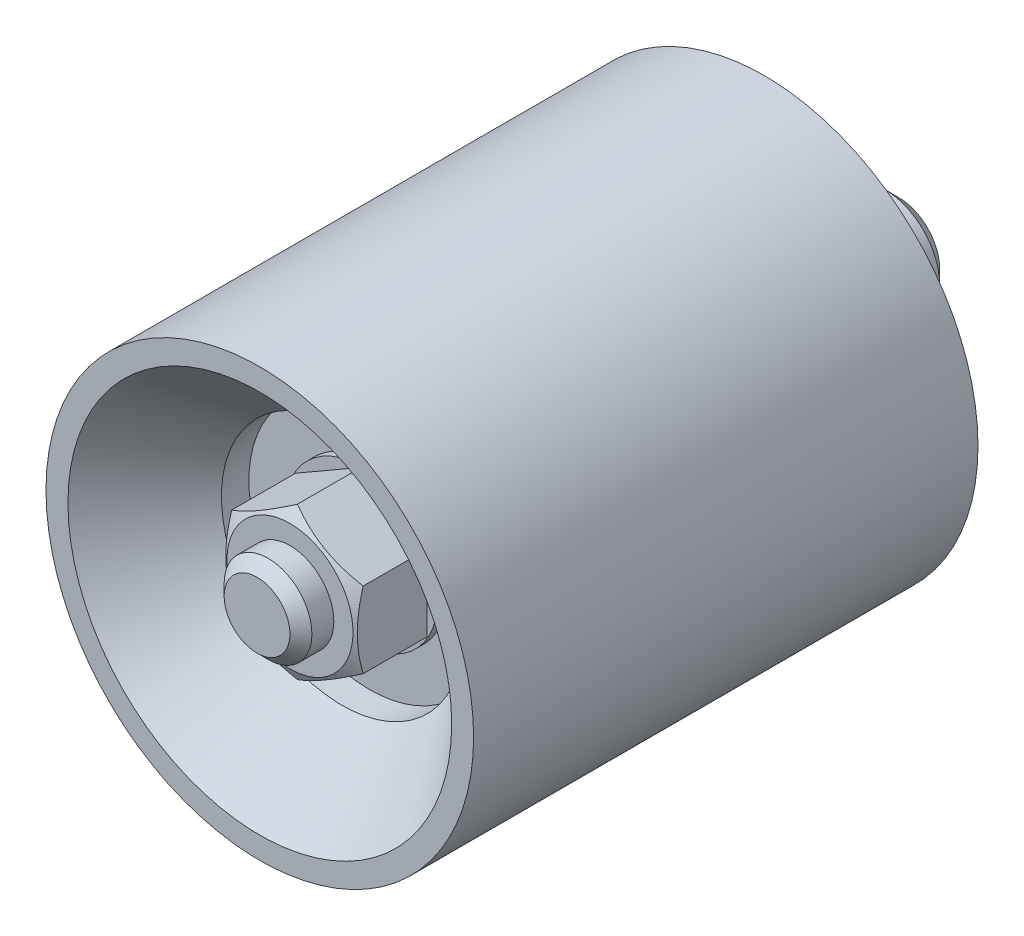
ISO-10303-21;
HEADER;
FILE_DESCRIPTION(('STEP AP214'),'2;1');
FILE_NAME('part.step','',(''),(''),'','','');
FILE_SCHEMA(('AUTOMOTIVE_DESIGN { 1 0 10303 214 1 1 1 1 }'));
ENDSEC;
DATA;
#1=APPLICATION_CONTEXT('core data for automotive mechanical design processes');
#2=APPLICATION_PROTOCOL_DEFINITION('international standard','automotive_design',2000,#1);
#3=PRODUCT_CONTEXT('',#1,'mechanical');
#4=PRODUCT('Part','Part','',(#3));
#5=PRODUCT_RELATED_PRODUCT_CATEGORY('part','',(#4));
#6=PRODUCT_DEFINITION_FORMATION('','',#4);
#7=PRODUCT_DEFINITION_CONTEXT('part definition',#1,'design');
#8=PRODUCT_DEFINITION('design','',#6,#7);
#9=PRODUCT_DEFINITION_SHAPE('','',#8);
#10=(LENGTH_UNIT() NAMED_UNIT(*) SI_UNIT(.MILLI.,.METRE.));
#11=(NAMED_UNIT(*) PLANE_ANGLE_UNIT() SI_UNIT($,.RADIAN.));
#12=(NAMED_UNIT(*) SI_UNIT($,.STERADIAN.) SOLID_ANGLE_UNIT());
#13=UNCERTAINTY_MEASURE_WITH_UNIT(LENGTH_MEASURE(1.E-05),#10,'distance_accuracy_value','');
#14=(GEOMETRIC_REPRESENTATION_CONTEXT(3) GLOBAL_UNCERTAINTY_ASSIGNED_CONTEXT((#13)) GLOBAL_UNIT_ASSIGNED_CONTEXT((#10,
#11,#12)) REPRESENTATION_CONTEXT('',''));
#15=CARTESIAN_POINT('',(0.,0.,0.));
#16=DIRECTION('',(0.,0.,1.));
#17=DIRECTION('',(1.,0.,0.));
#18=AXIS2_PLACEMENT_3D('',#15,#16,#17);
#19=CARTESIAN_POINT('',(0.,-50.,94.));
#20=DIRECTION('',(0.,0.,1.));
#21=DIRECTION('',(-1.,0.,0.));
#22=AXIS2_PLACEMENT_3D('',#19,#20,#21);
#23=PLANE('',#22);
#24=CARTESIAN_POINT('',(0.,0.,94.));
#25=DIRECTION('',(0.,0.,-1.));
#26=DIRECTION('',(1.,0.,0.));
#27=AXIS2_PLACEMENT_3D('',#24,#25,#26);
#28=CIRCLE('',#27,35.);
#29=CARTESIAN_POINT('',(35.,0.,94.));
#30=VERTEX_POINT('',#29);
#31=EDGE_CURVE('E196',#30,#30,#28,.T.);
#32=ORIENTED_EDGE('',*,*,#31,.T.);
#33=EDGE_LOOP('',(#32));
#34=FACE_BOUND('',#33,.T.);
#35=CARTESIAN_POINT('',(0.,0.,94.));
#36=DIRECTION('',(0.,0.,1.));
#37=DIRECTION('',(1.,0.,0.));
#38=AXIS2_PLACEMENT_3D('',#35,#36,#37);
#39=CIRCLE('',#38,39.);
#40=CARTESIAN_POINT('',(39.,0.,94.));
#41=VERTEX_POINT('',#40);
#42=EDGE_CURVE('E623',#41,#41,#39,.T.);
#43=ORIENTED_EDGE('',*,*,#42,.T.);
#44=EDGE_LOOP('',(#43));
#45=FACE_BOUND('',#44,.T.);
#46=ADVANCED_FACE('F15',(#34,#45),#23,.T.);
#47=CARTESIAN_POINT('',(0.,-10.,74.));
#48=DIRECTION('',(0.,0.,-1.));
#49=DIRECTION('',(1.,0.,0.));
#50=AXIS2_PLACEMENT_3D('',#47,#48,#49);
#51=PLANE('',#50);
#52=CARTESIAN_POINT('',(0.,0.,74.));
#53=DIRECTION('',(0.,0.,-1.));
#54=DIRECTION('',(1.,0.,0.));
#55=AXIS2_PLACEMENT_3D('',#52,#53,#54);
#56=CIRCLE('',#55,22.);
#57=CARTESIAN_POINT('',(22.,0.,74.));
#58=VERTEX_POINT('',#57);
#59=EDGE_CURVE('E151',#58,#58,#56,.T.);
#60=ORIENTED_EDGE('',*,*,#59,.F.);
#61=EDGE_LOOP('',(#60));
#62=FACE_BOUND('',#61,.T.);
#63=CARTESIAN_POINT('',(0.,0.,74.));
#64=DIRECTION('',(0.,0.,1.));
#65=DIRECTION('',(1.,0.,0.));
#66=AXIS2_PLACEMENT_3D('',#63,#64,#65);
#67=CIRCLE('',#66,14.);
#68=CARTESIAN_POINT('',(14.,0.,74.));
#69=VERTEX_POINT('',#68);
#70=EDGE_CURVE('E136',#69,#69,#67,.T.);
#71=ORIENTED_EDGE('',*,*,#70,.F.);
#72=EDGE_LOOP('',(#71));
#73=FACE_BOUND('',#72,.T.);
#74=ADVANCED_FACE('F345',(#62,#73),#51,.F.);
#75=CARTESIAN_POINT('',(0.,0.,28.0000000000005));
#76=DIRECTION('',(0.,0.,-1.));
#77=DIRECTION('',(1.,0.,0.));
#78=AXIS2_PLACEMENT_3D('',#75,#76,#77);
#79=CYLINDRICAL_SURFACE('',#78,22.);
#80=CARTESIAN_POINT('',(0.,0.,79.));
#81=DIRECTION('',(0.,0.,-1.));
#82=DIRECTION('',(1.,0.,0.));
#83=AXIS2_PLACEMENT_3D('',#80,#81,#82);
#84=CIRCLE('',#83,22.);
#85=CARTESIAN_POINT('',(22.,0.,79.));
#86=VERTEX_POINT('',#85);
#87=EDGE_CURVE('E199',#86,#86,#84,.T.);
#88=ORIENTED_EDGE('',*,*,#87,.F.);
#89=EDGE_LOOP('',(#88));
#90=FACE_BOUND('',#89,.T.);
#91=ORIENTED_EDGE('',*,*,#59,.T.);
#92=EDGE_LOOP('',(#91));
#93=FACE_BOUND('',#92,.T.);
#94=ADVANCED_FACE('F350',(#90,#93),#79,.F.);
#95=CARTESIAN_POINT('',(0.,0.,79.));
#96=DIRECTION('',(0.,0.,1.));
#97=DIRECTION('',(-1.,0.,0.));
#98=AXIS2_PLACEMENT_3D('',#95,#96,#97);
#99=CONICAL_SURFACE('',#98,22.,0.714090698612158);
#100=ORIENTED_EDGE('',*,*,#31,.F.);
#101=EDGE_LOOP('',(#100));
#102=FACE_BOUND('',#101,.T.);
#103=ORIENTED_EDGE('',*,*,#87,.T.);
#104=EDGE_LOOP('',(#103));
#105=FACE_BOUND('',#104,.T.);
#106=ADVANCED_FACE('F347',(#102,#105),#99,.F.);
#107=CARTESIAN_POINT('',(11.9944518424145,6.925,88.5));
#108=DIRECTION('',(-0.5,-0.866025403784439,0.));
#109=DIRECTION('',(0.866025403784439,-0.5,0.));
#110=AXIS2_PLACEMENT_3D('',#107,#108,#109);
#111=PLANE('',#110);
#112=DIRECTION('',(0.,0.,-1.));
#113=VECTOR('',#112,1.);
#114=CARTESIAN_POINT('',(0.,13.85,88.5));
#115=LINE('',#114,#113);
#116=CARTESIAN_POINT('',(0.,13.85,87.1432268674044));
#117=VERTEX_POINT('',#116);
#118=CARTESIAN_POINT('',(0.,13.85,75.5));
#119=VERTEX_POINT('',#118);
#120=EDGE_CURVE('E130',#117,#119,#115,.T.);
#121=ORIENTED_EDGE('',*,*,#120,.F.);
#122=CARTESIAN_POINT('',(-0.0002,13.8501154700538,87.143160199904));
#123=CARTESIAN_POINT('',(0.263463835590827,13.6978890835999,87.2310333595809));
#124=CARTESIAN_POINT('',(0.52811074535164,13.5450951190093,87.3149181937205));
#125=CARTESIAN_POINT('',(1.05952683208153,13.2382818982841,87.4736045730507));
#126=CARTESIAN_POINT('',(1.32629667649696,13.0842622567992,87.548403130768));
#127=CARTESIAN_POINT('',(2.13090464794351,12.6197216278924,87.7577218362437));
#128=CARTESIAN_POINT('',(2.67191906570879,12.3073668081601,87.876781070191));
#129=CARTESIAN_POINT('',(3.4815223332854,11.839942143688,88.0163886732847));
#130=CARTESIAN_POINT('',(3.74769248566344,11.6862687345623,88.0561575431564));
#131=CARTESIAN_POINT('',(4.2812651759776,11.3782103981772,88.1228471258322));
#132=CARTESIAN_POINT('',(4.54866773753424,11.2238254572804,88.1497675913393));
#133=CARTESIAN_POINT('',(5.0839186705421,10.9147981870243,88.1900708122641));
#134=CARTESIAN_POINT('',(5.35176613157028,10.760156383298,88.203469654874));
#135=CARTESIAN_POINT('',(5.8877092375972,10.450729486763,88.2164441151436));
#136=CARTESIAN_POINT('',(6.15580487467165,10.2959443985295,88.2160201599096));
#137=CARTESIAN_POINT('',(6.657010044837,10.0065734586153,88.2023137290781));
#138=CARTESIAN_POINT('',(6.89015532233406,9.87196696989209,88.1907031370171));
#139=CARTESIAN_POINT('',(7.35590964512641,9.60306358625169,88.1572465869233));
#140=CARTESIAN_POINT('',(7.58851865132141,9.46876671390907,88.1353999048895));
#141=CARTESIAN_POINT('',(8.05307401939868,9.20055554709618,88.0818520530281));
#142=CARTESIAN_POINT('',(8.28501967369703,9.06664166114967,88.050142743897));
#143=CARTESIAN_POINT('',(8.74782356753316,8.79944170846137,87.9774259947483));
#144=CARTESIAN_POINT('',(8.97868173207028,8.66615568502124,87.9364179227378));
#145=CARTESIAN_POINT('',(9.6794646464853,8.26155848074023,87.7984089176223));
#146=CARTESIAN_POINT('',(10.1473600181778,7.99141896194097,87.6876469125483));
#147=CARTESIAN_POINT('',(11.076173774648,7.4551680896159,87.4362623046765));
#148=CARTESIAN_POINT('',(11.537104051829,7.18904987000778,87.2956987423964));
#149=CARTESIAN_POINT('',(11.9946518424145,6.92488452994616,87.143160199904));
#150=B_SPLINE_CURVE_WITH_KNOTS('',3,(#122,#123,#124,#125,#126,#127,#128,#129,#130,#131,#132,
#133,#134,#135,#136,#137,#138,#139,#140,#141,#142,#143,#144,#145,#146,#147,#148,#149),
.UNSPECIFIED.,.F.,.F.,(4,2,2,2,2,2,2,2,2,2,2,2,2,4),(0.,0.950565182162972,1.90144205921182,
3.80724359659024,4.73675449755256,5.66628328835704,6.5947048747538,7.5230977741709,
8.33129276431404,9.13954492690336,9.94846589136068,10.7574418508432,12.4109696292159,
14.0612516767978),.UNSPECIFIED.);
#151=CARTESIAN_POINT('',(11.9944518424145,6.925,87.1432268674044));
#152=VERTEX_POINT('',#151);
#153=EDGE_CURVE('E190',#117,#152,#150,.T.);
#154=ORIENTED_EDGE('',*,*,#153,.T.);
#155=DIRECTION('',(0.,0.,-1.));
#156=VECTOR('',#155,1.);
#157=CARTESIAN_POINT('',(11.9944518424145,6.925,88.5));
#158=LINE('',#157,#156);
#159=CARTESIAN_POINT('',(11.9944518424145,6.925,75.5));
#160=VERTEX_POINT('',#159);
#161=EDGE_CURVE('E39',#152,#160,#158,.T.);
#162=ORIENTED_EDGE('',*,*,#161,.T.);
#163=DIRECTION('',(-0.866025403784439,0.5,0.));
#164=VECTOR('',#163,1.);
#165=CARTESIAN_POINT('',(11.9944518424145,6.925,75.5));
#166=LINE('',#165,#164);
#167=EDGE_CURVE('E637',#160,#119,#166,.T.);
#168=ORIENTED_EDGE('',*,*,#167,.T.);
#169=EDGE_LOOP('',(#121,#154,#162,#168));
#170=FACE_BOUND('',#169,.T.);
#171=ADVANCED_FACE('F230',(#170),#111,.F.);
#172=CARTESIAN_POINT('',(0.,13.85,88.5));
#173=DIRECTION('',(0.5,-0.866025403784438,0.));
#174=DIRECTION('',(0.866025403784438,0.5,0.));
#175=AXIS2_PLACEMENT_3D('',#172,#173,#174);
#176=PLANE('',#175);
#177=DIRECTION('',(0.,0.,-1.));
#178=VECTOR('',#177,1.);
#179=CARTESIAN_POINT('',(-11.9944518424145,6.925,88.5));
#180=LINE('',#179,#178);
#181=CARTESIAN_POINT('',(-11.9944518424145,6.925,87.1432268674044));
#182=VERTEX_POINT('',#181);
#183=CARTESIAN_POINT('',(-11.9944518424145,6.925,75.5));
#184=VERTEX_POINT('',#183);
#185=EDGE_CURVE('E83',#182,#184,#180,.T.);
#186=ORIENTED_EDGE('',*,*,#185,.F.);
#187=CARTESIAN_POINT('',(-11.9946518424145,6.92488452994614,87.143160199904));
#188=CARTESIAN_POINT('',(-11.7309880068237,7.07711091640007,87.2310333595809));
#189=CARTESIAN_POINT('',(-11.4663410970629,7.22990488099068,87.3149181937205));
#190=CARTESIAN_POINT('',(-10.934925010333,7.53671810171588,87.4736045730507));
#191=CARTESIAN_POINT('',(-10.6681551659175,7.69073774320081,87.548403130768));
#192=CARTESIAN_POINT('',(-9.86354719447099,8.15527837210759,87.7577218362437));
#193=CARTESIAN_POINT('',(-9.32253277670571,8.46763319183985,87.876781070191));
#194=CARTESIAN_POINT('',(-8.51292950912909,8.935057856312,88.0163886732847));
#195=CARTESIAN_POINT('',(-8.24675935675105,9.08873126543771,88.0561575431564));
#196=CARTESIAN_POINT('',(-7.71318666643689,9.39678960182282,88.1228471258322));
#197=CARTESIAN_POINT('',(-7.44578410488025,9.55117454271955,88.1497675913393));
#198=CARTESIAN_POINT('',(-6.91053317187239,9.86020181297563,88.1900708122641));
#199=CARTESIAN_POINT('',(-6.6426857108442,10.014843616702,88.203469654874));
#200=CARTESIAN_POINT('',(-6.10674260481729,10.324270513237,88.2164441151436));
#201=CARTESIAN_POINT('',(-5.83864696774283,10.4790556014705,88.2160201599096));
#202=CARTESIAN_POINT('',(-5.33744179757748,10.7684265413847,88.2023137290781));
#203=CARTESIAN_POINT('',(-5.10429652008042,10.9030330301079,88.1907031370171));
#204=CARTESIAN_POINT('',(-4.63854219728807,11.1719364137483,88.1572465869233));
#205=CARTESIAN_POINT('',(-4.40593319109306,11.3062332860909,88.1353999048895));
#206=CARTESIAN_POINT('',(-3.9413778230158,11.5744444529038,88.0818520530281));
#207=CARTESIAN_POINT('',(-3.70943216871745,11.7083583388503,88.050142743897));
#208=CARTESIAN_POINT('',(-3.24662827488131,11.9755582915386,87.9774259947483));
#209=CARTESIAN_POINT('',(-3.01577011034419,12.1088443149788,87.9364179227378));
#210=CARTESIAN_POINT('',(-2.31498719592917,12.5134415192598,87.7984089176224));
#211=CARTESIAN_POINT('',(-1.84709182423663,12.783581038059,87.6876469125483));
#212=CARTESIAN_POINT('',(-0.918278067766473,13.3198319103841,87.4362623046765));
#213=CARTESIAN_POINT('',(-0.45734779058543,13.5859501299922,87.2956987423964));
#214=CARTESIAN_POINT('',(0.000200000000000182,13.8501154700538,87.143160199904));
#215=B_SPLINE_CURVE_WITH_KNOTS('',3,(#187,#188,#189,#190,#191,#192,#193,#194,#195,#196,#197,
#198,#199,#200,#201,#202,#203,#204,#205,#206,#207,#208,#209,#210,#211,#212,#213,#214),
.UNSPECIFIED.,.F.,.F.,(4,2,2,2,2,2,2,2,2,2,2,2,2,4),(0.,0.950565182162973,1.90144205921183,
3.80724359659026,4.73675449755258,5.66628328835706,6.59470487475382,7.52309777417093,
8.33129276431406,9.13954492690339,9.94846589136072,10.7574418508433,12.410969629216,
14.0612516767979),.UNSPECIFIED.);
#216=EDGE_CURVE('E259',#182,#117,#215,.T.);
#217=ORIENTED_EDGE('',*,*,#216,.T.);
#218=ORIENTED_EDGE('',*,*,#120,.T.);
#219=DIRECTION('',(-0.866025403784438,-0.5,0.));
#220=VECTOR('',#219,1.);
#221=CARTESIAN_POINT('',(0.,13.85,75.5));
#222=LINE('',#221,#220);
#223=EDGE_CURVE('E121',#119,#184,#222,.T.);
#224=ORIENTED_EDGE('',*,*,#223,.T.);
#225=EDGE_LOOP('',(#186,#217,#218,#224));
#226=FACE_BOUND('',#225,.T.);
#227=ADVANCED_FACE('F269',(#226),#176,.F.);
#228=CARTESIAN_POINT('',(-11.9944518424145,6.925,88.5));
#229=DIRECTION('',(1.,0.,0.));
#230=DIRECTION('',(0.,0.,-1.));
#231=AXIS2_PLACEMENT_3D('',#228,#229,#230);
#232=PLANE('',#231);
#233=DIRECTION('',(0.,0.,-1.));
#234=VECTOR('',#233,1.);
#235=CARTESIAN_POINT('',(-11.9944518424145,-6.925,88.5));
#236=LINE('',#235,#234);
#237=CARTESIAN_POINT('',(-11.9944518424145,-6.925,87.1432268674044));
#238=VERTEX_POINT('',#237);
#239=CARTESIAN_POINT('',(-11.9944518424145,-6.925,75.5));
#240=VERTEX_POINT('',#239);
#241=EDGE_CURVE('E105',#238,#240,#236,.T.);
#242=ORIENTED_EDGE('',*,*,#241,.F.);
#243=CARTESIAN_POINT('',(-11.9944518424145,-18.7218551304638,82.3024108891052));
#244=CARTESIAN_POINT('',(-11.9944518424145,-18.4594129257,82.429991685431));
#245=CARTESIAN_POINT('',(-11.9944518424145,-18.196665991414,82.556945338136));
#246=CARTESIAN_POINT('',(-11.9944518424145,-17.6704991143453,82.8094565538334));
#247=CARTESIAN_POINT('',(-11.9944518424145,-17.4070791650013,82.9350141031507));
#248=CARTESIAN_POINT('',(-11.9944518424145,-16.6156459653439,83.3094122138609));
#249=CARTESIAN_POINT('',(-11.9944518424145,-16.0865351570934,83.5559412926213));
#250=CARTESIAN_POINT('',(-11.9944518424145,-15.0219906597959,84.0426690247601));
#251=CARTESIAN_POINT('',(-11.9944518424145,-14.4865383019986,84.2828269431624));
#252=CARTESIAN_POINT('',(-11.9944518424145,-13.4114172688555,84.7534781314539));
#253=CARTESIAN_POINT('',(-11.9944518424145,-12.8717487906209,84.9839718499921));
#254=CARTESIAN_POINT('',(-11.9944518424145,-11.7694679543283,85.4401361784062));
#255=CARTESIAN_POINT('',(-11.9944518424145,-11.206685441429,85.6653977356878));
#256=CARTESIAN_POINT('',(-11.9944518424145,-10.0745769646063,86.099162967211));
#257=CARTESIAN_POINT('',(-11.9944518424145,-9.5052502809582,86.3076647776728));
#258=CARTESIAN_POINT('',(-11.9944518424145,-8.36019316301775,86.7025218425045));
#259=CARTESIAN_POINT('',(-11.9944518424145,-7.78447795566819,86.8889209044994));
#260=CARTESIAN_POINT('',(-11.9944518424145,-6.62473572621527,87.233682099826));
#261=CARTESIAN_POINT('',(-11.9944518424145,-6.04071134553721,87.3920529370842));
#262=CARTESIAN_POINT('',(-11.9944518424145,-5.15995045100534,87.6024831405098));
#263=CARTESIAN_POINT('',(-11.9944518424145,-4.86640107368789,87.6679603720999));
#264=CARTESIAN_POINT('',(-11.9944518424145,-4.27727440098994,87.7891042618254));
#265=CARTESIAN_POINT('',(-11.9944518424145,-3.98169714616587,87.8447711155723));
#266=CARTESIAN_POINT('',(-11.9944518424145,-3.38870993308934,87.9453191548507));
#267=CARTESIAN_POINT('',(-11.9944518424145,-3.09130000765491,87.9902005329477));
#268=CARTESIAN_POINT('',(-11.9944518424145,-2.4949524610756,88.0682870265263));
#269=CARTESIAN_POINT('',(-11.9944518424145,-2.19601490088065,88.101492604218));
#270=CARTESIAN_POINT('',(-11.9944518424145,-1.60098604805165,88.1551446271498));
#271=CARTESIAN_POINT('',(-11.9944518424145,-1.3049095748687,88.1757544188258));
#272=CARTESIAN_POINT('',(-11.9944518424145,-0.712150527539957,88.2044285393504));
#273=CARTESIAN_POINT('',(-11.9944518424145,-0.415467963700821,88.2124930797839));
#274=CARTESIAN_POINT('',(-11.9944518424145,0.177973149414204,88.2158843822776));
#275=CARTESIAN_POINT('',(-11.9944518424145,0.474731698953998,88.2112110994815));
#276=CARTESIAN_POINT('',(-11.9944518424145,1.06778454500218,88.1892421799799));
#277=CARTESIAN_POINT('',(-11.9944518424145,1.36407882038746,88.171945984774));
#278=CARTESIAN_POINT('',(-11.9944518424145,2.07252202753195,88.1158696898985));
#279=CARTESIAN_POINT('',(-11.9944518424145,2.48422124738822,88.0713032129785));
#280=CARTESIAN_POINT('',(-11.9944518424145,3.30464577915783,87.9601978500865));
#281=CARTESIAN_POINT('',(-11.9944518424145,3.71337069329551,87.893656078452));
#282=CARTESIAN_POINT('',(-11.9944518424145,4.527428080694,87.7409669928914));
#283=CARTESIAN_POINT('',(-11.9944518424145,4.93275773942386,87.6548048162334));
#284=CARTESIAN_POINT('',(-11.9944518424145,5.73939154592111,87.4655105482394));
#285=CARTESIAN_POINT('',(-11.9944518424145,6.14069574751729,87.3623786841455));
#286=CARTESIAN_POINT('',(-11.9944518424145,6.94823590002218,87.139187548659));
#287=CARTESIAN_POINT('',(-11.9944518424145,7.35438063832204,87.0188005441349));
#288=CARTESIAN_POINT('',(-11.9944518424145,8.16267065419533,86.7653434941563));
#289=CARTESIAN_POINT('',(-11.9944518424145,8.56481590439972,86.6322733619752));
#290=CARTESIAN_POINT('',(-11.9944518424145,9.36530216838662,86.3555843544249));
#291=CARTESIAN_POINT('',(-11.9944518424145,9.76364433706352,86.2119688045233));
#292=CARTESIAN_POINT('',(-11.9944518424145,10.5570108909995,85.9159025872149));
#293=CARTESIAN_POINT('',(-11.9944518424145,10.9520353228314,85.7634520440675));
#294=CARTESIAN_POINT('',(-11.9944518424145,11.913701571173,85.3819238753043));
#295=CARTESIAN_POINT('',(-11.9944518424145,12.4787553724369,85.148848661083));
#296=CARTESIAN_POINT('',(-11.9944518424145,13.6038043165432,84.6707564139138));
#297=CARTESIAN_POINT('',(-11.9944518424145,14.1637990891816,84.4257385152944));
#298=CARTESIAN_POINT('',(-11.9944518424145,15.2797216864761,83.9262536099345));
#299=CARTESIAN_POINT('',(-11.9944518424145,15.8356484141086,83.6717841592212));
#300=CARTESIAN_POINT('',(-11.9944518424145,16.9439999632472,83.1553861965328));
#301=CARTESIAN_POINT('',(-11.9944518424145,17.496424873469,82.8934578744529));
#302=CARTESIAN_POINT('',(-11.9944518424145,18.5990525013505,82.3632683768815));
#303=CARTESIAN_POINT('',(-11.9944518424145,19.1492516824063,82.0949998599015));
#304=CARTESIAN_POINT('',(-11.9944518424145,20.2472311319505,81.5535577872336));
#305=CARTESIAN_POINT('',(-11.9944518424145,20.7950113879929,81.2803842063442));
#306=CARTESIAN_POINT('',(-11.9944518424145,21.8884570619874,80.7300440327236));
#307=CARTESIAN_POINT('',(-11.9944518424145,22.4341227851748,80.4528780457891));
#308=CARTESIAN_POINT('',(-11.9944518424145,23.5237368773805,79.8951888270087));
#309=CARTESIAN_POINT('',(-11.9944518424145,24.067685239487,79.6146655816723));
#310=CARTESIAN_POINT('',(-11.9944518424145,25.6006418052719,78.8190804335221));
#311=CARTESIAN_POINT('',(-11.9944518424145,26.5879626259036,78.3007674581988));
#312=CARTESIAN_POINT('',(-11.9944518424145,28.5589924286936,77.2572377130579));
#313=CARTESIAN_POINT('',(-11.9944518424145,29.5427012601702,76.7320206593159));
#314=CARTESIAN_POINT('',(-11.9944518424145,31.5046220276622,75.6777728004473));
#315=CARTESIAN_POINT('',(-11.9944518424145,32.4828416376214,75.1487562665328));
#316=CARTESIAN_POINT('',(-11.9944518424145,33.9484822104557,74.352197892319));
#317=CARTESIAN_POINT('',(-11.9944518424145,34.4367330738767,74.0861808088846));
#318=CARTESIAN_POINT('',(-11.9944518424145,35.4127376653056,73.5532378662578));
#319=CARTESIAN_POINT('',(-11.9944518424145,35.9004913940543,73.2863120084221));
#320=CARTESIAN_POINT('',(-11.9944518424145,36.3880253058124,73.0189851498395));
#321=B_SPLINE_CURVE_WITH_KNOTS('',3,(#243,#244,#245,#246,#247,#248,#249,#250,#251,#252,#253,
#254,#255,#256,#257,#258,#259,#260,#261,#262,#263,#264,#265,#266,#267,#268,#269,#270,#271,#272,
#273,#274,#275,#276,#277,#278,#279,#280,#281,#282,#283,#284,#285,#286,#287,#288,#289,#290,#291,
#292,#293,#294,#295,#296,#297,#298,#299,#300,#301,#302,#303,#304,#305,#306,#307,#308,#309,#310,
#311,#312,#313,#314,#315,#316,#317,#318,#319,#320),.UNSPECIFIED.,.F.,.F.,(4,2,2,2,2,2,2,2,2,2,2,
2,2,2,2,2,2,2,2,2,2,2,2,2,2,2,2,2,2,2,2,2,2,2,2,2,2,2,4),(0.,0.875426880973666,1.75086232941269,
3.50198616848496,5.2624415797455,7.02281517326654,8.84118283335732,10.6597524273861,
12.4746551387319,14.288993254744,15.1911454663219,16.0932796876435,16.9953978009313,
17.8974801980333,18.7876010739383,19.6777069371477,20.5678159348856,21.4579643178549,
22.699593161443,23.9413851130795,25.1841208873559,26.4268400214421,27.6974270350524,
28.9680227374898,30.2382194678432,31.5083983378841,33.3419163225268,35.175567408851,
37.0096959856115,38.8437779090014,40.6800991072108,42.5164297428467,44.3524846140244,
46.188546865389,49.5338088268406,52.8792087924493,56.2155032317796,57.8835510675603,
59.5515964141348),.UNSPECIFIED.);
#322=EDGE_CURVE('E253',#238,#182,#321,.T.);
#323=ORIENTED_EDGE('',*,*,#322,.T.);
#324=ORIENTED_EDGE('',*,*,#185,.T.);
#325=DIRECTION('',(0.,-1.,0.));
#326=VECTOR('',#325,1.);
#327=CARTESIAN_POINT('',(-11.9944518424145,6.925,75.5));
#328=LINE('',#327,#326);
#329=EDGE_CURVE('E119',#184,#240,#328,.T.);
#330=ORIENTED_EDGE('',*,*,#329,.T.);
#331=EDGE_LOOP('',(#242,#323,#324,#330));
#332=FACE_BOUND('',#331,.T.);
#333=ADVANCED_FACE('F266',(#332),#232,.F.);
#334=CARTESIAN_POINT('',(-11.9944518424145,-6.925,88.5));
#335=DIRECTION('',(0.5,0.866025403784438,0.));
#336=DIRECTION('',(-0.866025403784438,0.5,0.));
#337=AXIS2_PLACEMENT_3D('',#334,#335,#336);
#338=PLANE('',#337);
#339=DIRECTION('',(0.,0.,-1.));
#340=VECTOR('',#339,1.);
#341=CARTESIAN_POINT('',(0.,-13.85,88.5));
#342=LINE('',#341,#340);
#343=CARTESIAN_POINT('',(0.,-13.85,87.1432268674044));
#344=VERTEX_POINT('',#343);
#345=CARTESIAN_POINT('',(0.,-13.85,75.5));
#346=VERTEX_POINT('',#345);
#347=EDGE_CURVE('E96',#344,#346,#342,.T.);
#348=ORIENTED_EDGE('',*,*,#347,.F.);
#349=CARTESIAN_POINT('',(0.000200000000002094,-13.8501154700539,87.143160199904));
#350=CARTESIAN_POINT('',(-0.263463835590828,-13.6978890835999,87.2310333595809));
#351=CARTESIAN_POINT('',(-0.528110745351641,-13.5450951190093,87.3149181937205));
#352=CARTESIAN_POINT('',(-1.05952683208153,-13.2382818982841,87.4736045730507));
#353=CARTESIAN_POINT('',(-1.32629667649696,-13.0842622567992,87.548403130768));
#354=CARTESIAN_POINT('',(-2.13090464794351,-12.6197216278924,87.7577218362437));
#355=CARTESIAN_POINT('',(-2.67191906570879,-12.3073668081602,87.876781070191));
#356=CARTESIAN_POINT('',(-3.48152233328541,-11.839942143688,88.0163886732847));
#357=CARTESIAN_POINT('',(-3.74769248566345,-11.6862687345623,88.0561575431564));
#358=CARTESIAN_POINT('',(-4.28126517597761,-11.3782103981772,88.1228471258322));
#359=CARTESIAN_POINT('',(-4.54866773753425,-11.2238254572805,88.1497675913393));
#360=CARTESIAN_POINT('',(-5.08391867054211,-10.9147981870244,88.1900708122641));
#361=CARTESIAN_POINT('',(-5.3517661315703,-10.760156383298,88.203469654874));
#362=CARTESIAN_POINT('',(-5.88770923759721,-10.450729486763,88.2164441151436));
#363=CARTESIAN_POINT('',(-6.15580487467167,-10.2959443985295,88.2160201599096));
#364=CARTESIAN_POINT('',(-6.65701004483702,-10.0065734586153,88.2023137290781));
#365=CARTESIAN_POINT('',(-6.89015532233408,-9.8719669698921,88.1907031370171));
#366=CARTESIAN_POINT('',(-7.35590964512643,-9.60306358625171,88.1572465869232));
#367=CARTESIAN_POINT('',(-7.58851865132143,-9.46876671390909,88.1353999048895));
#368=CARTESIAN_POINT('',(-8.0530740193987,-9.2005555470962,88.0818520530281));
#369=CARTESIAN_POINT('',(-8.28501967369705,-9.06664166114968,88.050142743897));
#370=CARTESIAN_POINT('',(-8.74782356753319,-8.79944170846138,87.9774259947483));
#371=CARTESIAN_POINT('',(-8.97868173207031,-8.66615568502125,87.9364179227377));
#372=CARTESIAN_POINT('',(-9.67946464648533,-8.26155848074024,87.7984089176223));
#373=CARTESIAN_POINT('',(-10.1473600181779,-7.99141896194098,87.6876469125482));
#374=CARTESIAN_POINT('',(-11.076173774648,-7.4551680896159,87.4362623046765));
#375=CARTESIAN_POINT('',(-11.5371040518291,-7.18904987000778,87.2956987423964));
#376=CARTESIAN_POINT('',(-11.9946518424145,-6.92488452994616,87.143160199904));
#377=B_SPLINE_CURVE_WITH_KNOTS('',3,(#349,#350,#351,#352,#353,#354,#355,#356,#357,#358,#359,
#360,#361,#362,#363,#364,#365,#366,#367,#368,#369,#370,#371,#372,#373,#374,#375,#376),
.UNSPECIFIED.,.F.,.F.,(4,2,2,2,2,2,2,2,2,2,2,2,2,4),(0.,0.950565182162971,1.90144205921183,
3.80724359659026,4.73675449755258,5.66628328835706,6.59470487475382,7.52309777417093,
8.33129276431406,9.13954492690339,9.94846589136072,10.7574418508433,12.410969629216,
14.0612516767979),.UNSPECIFIED.);
#378=EDGE_CURVE('E245',#344,#238,#377,.T.);
#379=ORIENTED_EDGE('',*,*,#378,.T.);
#380=ORIENTED_EDGE('',*,*,#241,.T.);
#381=DIRECTION('',(0.866025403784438,-0.5,0.));
#382=VECTOR('',#381,1.);
#383=CARTESIAN_POINT('',(-11.9944518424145,-6.925,75.5));
#384=LINE('',#383,#382);
#385=EDGE_CURVE('E113',#240,#346,#384,.T.);
#386=ORIENTED_EDGE('',*,*,#385,.T.);
#387=EDGE_LOOP('',(#348,#379,#380,#386));
#388=FACE_BOUND('',#387,.T.);
#389=ADVANCED_FACE('F117',(#388),#338,.F.);
#390=CARTESIAN_POINT('',(0.,-13.85,88.5));
#391=DIRECTION('',(-0.5,0.866025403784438,0.));
#392=DIRECTION('',(-0.866025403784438,-0.5,0.));
#393=AXIS2_PLACEMENT_3D('',#390,#391,#392);
#394=PLANE('',#393);
#395=DIRECTION('',(0.,0.,-1.));
#396=VECTOR('',#395,1.);
#397=CARTESIAN_POINT('',(11.9944518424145,-6.925,88.5));
#398=LINE('',#397,#396);
#399=CARTESIAN_POINT('',(11.9944518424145,-6.925,87.1432268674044));
#400=VERTEX_POINT('',#399);
#401=CARTESIAN_POINT('',(11.9944518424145,-6.925,75.5));
#402=VERTEX_POINT('',#401);
#403=EDGE_CURVE('E106',#400,#402,#398,.T.);
#404=ORIENTED_EDGE('',*,*,#403,.F.);
#405=CARTESIAN_POINT('',(11.9946518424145,-6.92488452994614,87.143160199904));
#406=CARTESIAN_POINT('',(11.7309880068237,-7.07711091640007,87.2310333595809));
#407=CARTESIAN_POINT('',(11.4663410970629,-7.22990488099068,87.3149181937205));
#408=CARTESIAN_POINT('',(10.934925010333,-7.53671810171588,87.4736045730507));
#409=CARTESIAN_POINT('',(10.6681551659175,-7.69073774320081,87.548403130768));
#410=CARTESIAN_POINT('',(9.86354719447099,-8.15527837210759,87.7577218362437));
#411=CARTESIAN_POINT('',(9.32253277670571,-8.46763319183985,87.876781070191));
#412=CARTESIAN_POINT('',(8.51292950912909,-8.935057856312,88.0163886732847));
#413=CARTESIAN_POINT('',(8.24675935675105,-9.08873126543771,88.0561575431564));
#414=CARTESIAN_POINT('',(7.71318666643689,-9.39678960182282,88.1228471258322));
#415=CARTESIAN_POINT('',(7.44578410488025,-9.55117454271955,88.1497675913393));
#416=CARTESIAN_POINT('',(6.91053317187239,-9.86020181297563,88.1900708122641));
#417=CARTESIAN_POINT('',(6.6426857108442,-10.014843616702,88.203469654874));
#418=CARTESIAN_POINT('',(6.10674260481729,-10.324270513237,88.2164441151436));
#419=CARTESIAN_POINT('',(5.83864696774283,-10.4790556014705,88.2160201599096));
#420=CARTESIAN_POINT('',(5.33744179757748,-10.7684265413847,88.2023137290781));
#421=CARTESIAN_POINT('',(5.10429652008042,-10.9030330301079,88.1907031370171));
#422=CARTESIAN_POINT('',(4.63854219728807,-11.1719364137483,88.1572465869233));
#423=CARTESIAN_POINT('',(4.40593319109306,-11.3062332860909,88.1353999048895));
#424=CARTESIAN_POINT('',(3.9413778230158,-11.5744444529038,88.0818520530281));
#425=CARTESIAN_POINT('',(3.70943216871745,-11.7083583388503,88.050142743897));
#426=CARTESIAN_POINT('',(3.24662827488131,-11.9755582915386,87.9774259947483));
#427=CARTESIAN_POINT('',(3.01577011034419,-12.1088443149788,87.9364179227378));
#428=CARTESIAN_POINT('',(2.31498719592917,-12.5134415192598,87.7984089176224));
#429=CARTESIAN_POINT('',(1.84709182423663,-12.783581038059,87.6876469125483));
#430=CARTESIAN_POINT('',(0.918278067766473,-13.3198319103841,87.4362623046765));
#431=CARTESIAN_POINT('',(0.45734779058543,-13.5859501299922,87.2956987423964));
#432=CARTESIAN_POINT('',(-0.000200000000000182,-13.8501154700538,87.143160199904));
#433=B_SPLINE_CURVE_WITH_KNOTS('',3,(#405,#406,#407,#408,#409,#410,#411,#412,#413,#414,#415,
#416,#417,#418,#419,#420,#421,#422,#423,#424,#425,#426,#427,#428,#429,#430,#431,#432),
.UNSPECIFIED.,.F.,.F.,(4,2,2,2,2,2,2,2,2,2,2,2,2,4),(0.,0.950565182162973,1.90144205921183,
3.80724359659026,4.73675449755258,5.66628328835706,6.59470487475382,7.52309777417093,
8.33129276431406,9.13954492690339,9.94846589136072,10.7574418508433,12.410969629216,
14.0612516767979),.UNSPECIFIED.);
#434=EDGE_CURVE('E31',#400,#344,#433,.T.);
#435=ORIENTED_EDGE('',*,*,#434,.T.);
#436=ORIENTED_EDGE('',*,*,#347,.T.);
#437=DIRECTION('',(0.866025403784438,0.5,0.));
#438=VECTOR('',#437,1.);
#439=CARTESIAN_POINT('',(0.,-13.85,75.5));
#440=LINE('',#439,#438);
#441=EDGE_CURVE('E100',#346,#402,#440,.T.);
#442=ORIENTED_EDGE('',*,*,#441,.T.);
#443=EDGE_LOOP('',(#404,#435,#436,#442));
#444=FACE_BOUND('',#443,.T.);
#445=ADVANCED_FACE('F99',(#444),#394,.F.);
#446=CARTESIAN_POINT('',(11.9944518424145,-6.925,88.5));
#447=DIRECTION('',(-1.,0.,0.));
#448=DIRECTION('',(0.,-1.,0.));
#449=AXIS2_PLACEMENT_3D('',#446,#447,#448);
#450=PLANE('',#449);
#451=ORIENTED_EDGE('',*,*,#161,.F.);
#452=CARTESIAN_POINT('',(11.9944518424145,-18.7218551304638,82.3024108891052));
#453=CARTESIAN_POINT('',(11.9944518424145,-18.4594129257,82.429991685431));
#454=CARTESIAN_POINT('',(11.9944518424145,-18.196665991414,82.556945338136));
#455=CARTESIAN_POINT('',(11.9944518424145,-17.6704991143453,82.8094565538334));
#456=CARTESIAN_POINT('',(11.9944518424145,-17.4070791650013,82.9350141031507));
#457=CARTESIAN_POINT('',(11.9944518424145,-16.6156459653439,83.3094122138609));
#458=CARTESIAN_POINT('',(11.9944518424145,-16.0865351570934,83.5559412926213));
#459=CARTESIAN_POINT('',(11.9944518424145,-15.0219906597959,84.0426690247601));
#460=CARTESIAN_POINT('',(11.9944518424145,-14.4865383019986,84.2828269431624));
#461=CARTESIAN_POINT('',(11.9944518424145,-13.4114172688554,84.7534781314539));
#462=CARTESIAN_POINT('',(11.9944518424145,-12.8717487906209,84.9839718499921));
#463=CARTESIAN_POINT('',(11.9944518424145,-11.7694679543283,85.4401361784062));
#464=CARTESIAN_POINT('',(11.9944518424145,-11.206685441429,85.6653977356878));
#465=CARTESIAN_POINT('',(11.9944518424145,-10.0745769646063,86.099162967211));
#466=CARTESIAN_POINT('',(11.9944518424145,-9.5052502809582,86.3076647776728));
#467=CARTESIAN_POINT('',(11.9944518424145,-8.36019316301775,86.7025218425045));
#468=CARTESIAN_POINT('',(11.9944518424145,-7.78447795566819,86.8889209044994));
#469=CARTESIAN_POINT('',(11.9944518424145,-6.62473572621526,87.233682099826));
#470=CARTESIAN_POINT('',(11.9944518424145,-6.0407113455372,87.3920529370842));
#471=CARTESIAN_POINT('',(11.9944518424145,-5.15995045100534,87.6024831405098));
#472=CARTESIAN_POINT('',(11.9944518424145,-4.86640107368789,87.6679603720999));
#473=CARTESIAN_POINT('',(11.9944518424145,-4.27727440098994,87.7891042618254));
#474=CARTESIAN_POINT('',(11.9944518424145,-3.98169714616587,87.8447711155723));
#475=CARTESIAN_POINT('',(11.9944518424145,-3.38870993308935,87.9453191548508));
#476=CARTESIAN_POINT('',(11.9944518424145,-3.09130000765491,87.9902005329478));
#477=CARTESIAN_POINT('',(11.9944518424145,-2.49495246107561,88.0682870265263));
#478=CARTESIAN_POINT('',(11.9944518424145,-2.19601490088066,88.101492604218));
#479=CARTESIAN_POINT('',(11.9944518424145,-1.60098604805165,88.1551446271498));
#480=CARTESIAN_POINT('',(11.9944518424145,-1.30490957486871,88.1757544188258));
#481=CARTESIAN_POINT('',(11.9944518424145,-0.712150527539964,88.2044285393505));
#482=CARTESIAN_POINT('',(11.9944518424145,-0.415467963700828,88.2124930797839));
#483=CARTESIAN_POINT('',(11.9944518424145,0.177973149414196,88.2158843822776));
#484=CARTESIAN_POINT('',(11.9944518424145,0.47473169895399,88.2112110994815));
#485=CARTESIAN_POINT('',(11.9944518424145,1.06778454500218,88.1892421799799));
#486=CARTESIAN_POINT('',(11.9944518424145,1.36407882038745,88.171945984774));
#487=CARTESIAN_POINT('',(11.9944518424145,2.07252202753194,88.1158696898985));
#488=CARTESIAN_POINT('',(11.9944518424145,2.48422124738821,88.0713032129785));
#489=CARTESIAN_POINT('',(11.9944518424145,3.30464577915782,87.9601978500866));
#490=CARTESIAN_POINT('',(11.9944518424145,3.71337069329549,87.8936560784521));
#491=CARTESIAN_POINT('',(11.9944518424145,4.52742808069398,87.7409669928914));
#492=CARTESIAN_POINT('',(11.9944518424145,4.93275773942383,87.6548048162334));
#493=CARTESIAN_POINT('',(11.9944518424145,5.73939154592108,87.4655105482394));
#494=CARTESIAN_POINT('',(11.9944518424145,6.14069574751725,87.3623786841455));
#495=CARTESIAN_POINT('',(11.9944518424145,6.94823590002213,87.139187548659));
#496=CARTESIAN_POINT('',(11.9944518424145,7.35438063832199,87.0188005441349));
#497=CARTESIAN_POINT('',(11.9944518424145,8.16267065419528,86.7653434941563));
#498=CARTESIAN_POINT('',(11.9944518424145,8.56481590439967,86.6322733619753));
#499=CARTESIAN_POINT('',(11.9944518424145,9.36530216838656,86.3555843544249));
#500=CARTESIAN_POINT('',(11.9944518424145,9.76364433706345,86.2119688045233));
#501=CARTESIAN_POINT('',(11.9944518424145,10.5570108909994,85.9159025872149));
#502=CARTESIAN_POINT('',(11.9944518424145,10.9520353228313,85.7634520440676));
#503=CARTESIAN_POINT('',(11.9944518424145,11.9137015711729,85.3819238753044));
#504=CARTESIAN_POINT('',(11.9944518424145,12.4787553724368,85.148848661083));
#505=CARTESIAN_POINT('',(11.9944518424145,13.6038043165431,84.6707564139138));
#506=CARTESIAN_POINT('',(11.9944518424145,14.1637990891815,84.4257385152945));
#507=CARTESIAN_POINT('',(11.9944518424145,15.2797216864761,83.9262536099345));
#508=CARTESIAN_POINT('',(11.9944518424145,15.8356484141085,83.6717841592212));
#509=CARTESIAN_POINT('',(11.9944518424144,16.9439999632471,83.1553861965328));
#510=CARTESIAN_POINT('',(11.9944518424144,17.4964248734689,82.8934578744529));
#511=CARTESIAN_POINT('',(11.9944518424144,18.5990525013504,82.3632683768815));
#512=CARTESIAN_POINT('',(11.9944518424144,19.1492516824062,82.0949998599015));
#513=CARTESIAN_POINT('',(11.9944518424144,20.2472311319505,81.5535577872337));
#514=CARTESIAN_POINT('',(11.9944518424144,20.7950113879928,81.2803842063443));
#515=CARTESIAN_POINT('',(11.9944518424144,21.8884570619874,80.7300440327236));
#516=CARTESIAN_POINT('',(11.9944518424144,22.4341227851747,80.4528780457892));
#517=CARTESIAN_POINT('',(11.9944518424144,23.5237368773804,79.8951888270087));
#518=CARTESIAN_POINT('',(11.9944518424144,24.0676852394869,79.6146655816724));
#519=CARTESIAN_POINT('',(11.9944518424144,25.6006418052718,78.8190804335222));
#520=CARTESIAN_POINT('',(11.9944518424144,26.5879626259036,78.3007674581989));
#521=CARTESIAN_POINT('',(11.9944518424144,28.5589924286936,77.257237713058));
#522=CARTESIAN_POINT('',(11.9944518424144,29.5427012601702,76.732020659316));
#523=CARTESIAN_POINT('',(11.9944518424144,31.5046220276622,75.6777728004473));
#524=CARTESIAN_POINT('',(11.9944518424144,32.4828416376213,75.1487562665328));
#525=CARTESIAN_POINT('',(11.9944518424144,33.9484822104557,74.352197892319));
#526=CARTESIAN_POINT('',(11.9944518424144,34.4367330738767,74.0861808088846));
#527=CARTESIAN_POINT('',(11.9944518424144,35.4127376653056,73.5532378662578));
#528=CARTESIAN_POINT('',(11.9944518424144,35.9004913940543,73.2863120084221));
#529=CARTESIAN_POINT('',(11.9944518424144,36.3880253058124,73.0189851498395));
#530=B_SPLINE_CURVE_WITH_KNOTS('',3,(#452,#453,#454,#455,#456,#457,#458,#459,#460,#461,#462,
#463,#464,#465,#466,#467,#468,#469,#470,#471,#472,#473,#474,#475,#476,#477,#478,#479,#480,#481,
#482,#483,#484,#485,#486,#487,#488,#489,#490,#491,#492,#493,#494,#495,#496,#497,#498,#499,#500,
#501,#502,#503,#504,#505,#506,#507,#508,#509,#510,#511,#512,#513,#514,#515,#516,#517,#518,#519,
#520,#521,#522,#523,#524,#525,#526,#527,#528,#529),.UNSPECIFIED.,.F.,.F.,(4,2,2,2,2,2,2,2,2,2,2,
2,2,2,2,2,2,2,2,2,2,2,2,2,2,2,2,2,2,2,2,2,2,2,2,2,2,2,4),(0.,0.875426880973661,1.7508623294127,
3.50198616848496,5.26244157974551,7.02281517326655,8.84118283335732,10.6597524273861,
12.474655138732,14.288993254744,15.1911454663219,16.0932796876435,16.9953978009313,
17.8974801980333,18.7876010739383,19.6777069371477,20.5678159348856,21.4579643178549,
22.699593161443,23.9413851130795,25.1841208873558,26.426840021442,27.6974270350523,
28.9680227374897,30.2382194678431,31.508398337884,33.3419163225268,35.1755674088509,
37.0096959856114,38.8437779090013,40.6800991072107,42.5164297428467,44.3524846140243,
46.188546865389,49.5338088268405,52.8792087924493,56.2155032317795,57.8835510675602,
59.5515964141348),.UNSPECIFIED.);
#531=EDGE_CURVE('E9',#152,#400,#530,.F.);
#532=ORIENTED_EDGE('',*,*,#531,.T.);
#533=ORIENTED_EDGE('',*,*,#403,.T.);
#534=DIRECTION('',(0.,1.,0.));
#535=VECTOR('',#534,1.);
#536=CARTESIAN_POINT('',(11.9944518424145,-6.925,75.5));
#537=LINE('',#536,#535);
#538=EDGE_CURVE('E115',#402,#160,#537,.T.);
#539=ORIENTED_EDGE('',*,*,#538,.T.);
#540=EDGE_LOOP('',(#451,#532,#533,#539));
#541=FACE_BOUND('',#540,.T.);
#542=ADVANCED_FACE('F223',(#541),#450,.F.);
#543=CARTESIAN_POINT('',(0.,0.,75.5));
#544=DIRECTION('',(0.,0.,-1.));
#545=DIRECTION('',(-1.,0.,0.));
#546=AXIS2_PLACEMENT_3D('',#543,#544,#545);
#547=CYLINDRICAL_SURFACE('',#546,14.);
#548=CARTESIAN_POINT('',(0.,0.,75.5));
#549=DIRECTION('',(0.,0.,1.));
#550=DIRECTION('',(1.,0.,0.));
#551=AXIS2_PLACEMENT_3D('',#548,#549,#550);
#552=CIRCLE('',#551,14.);
#553=CARTESIAN_POINT('',(14.,0.,75.5));
#554=VERTEX_POINT('',#553);
#555=EDGE_CURVE('E141',#554,#554,#552,.T.);
#556=ORIENTED_EDGE('',*,*,#555,.F.);
#557=EDGE_LOOP('',(#556));
#558=FACE_BOUND('',#557,.T.);
#559=ORIENTED_EDGE('',*,*,#70,.T.);
#560=EDGE_LOOP('',(#559));
#561=FACE_BOUND('',#560,.T.);
#562=ADVANCED_FACE('F228',(#558,#561),#547,.T.);
#563=CARTESIAN_POINT('',(0.,0.,75.5));
#564=DIRECTION('',(0.,0.,1.));
#565=DIRECTION('',(1.,0.,0.));
#566=AXIS2_PLACEMENT_3D('',#563,#564,#565);
#567=PLANE('',#566);
#568=ORIENTED_EDGE('',*,*,#167,.F.);
#569=ORIENTED_EDGE('',*,*,#538,.F.);
#570=ORIENTED_EDGE('',*,*,#441,.F.);
#571=ORIENTED_EDGE('',*,*,#385,.F.);
#572=ORIENTED_EDGE('',*,*,#329,.F.);
#573=ORIENTED_EDGE('',*,*,#223,.F.);
#574=EDGE_LOOP('',(#568,#569,#570,#571,#572,#573));
#575=FACE_BOUND('',#574,.T.);
#576=ORIENTED_EDGE('',*,*,#555,.T.);
#577=EDGE_LOOP('',(#576));
#578=FACE_BOUND('',#577,.T.);
#579=ADVANCED_FACE('F111',(#575,#578),#567,.T.);
#580=CARTESIAN_POINT('',(0.,0.,88.5));
#581=DIRECTION('',(0.,0.,-1.));
#582=DIRECTION('',(-1.,0.,0.));
#583=AXIS2_PLACEMENT_3D('',#580,#581,#582);
#584=CONICAL_SURFACE('',#583,11.5,1.0471975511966);
#585=CARTESIAN_POINT('',(0.,0.,88.5));
#586=DIRECTION('',(0.,0.,-1.));
#587=DIRECTION('',(-1.,0.,0.));
#588=AXIS2_PLACEMENT_3D('',#585,#586,#587);
#589=CIRCLE('',#588,11.5);
#590=CARTESIAN_POINT('',(-11.5,0.,88.5));
#591=VERTEX_POINT('',#590);
#592=EDGE_CURVE('E246',#591,#591,#589,.T.);
#593=ORIENTED_EDGE('',*,*,#592,.T.);
#594=EDGE_LOOP('',(#593));
#595=FACE_BOUND('',#594,.T.);
#596=ORIENTED_EDGE('',*,*,#216,.F.);
#597=ORIENTED_EDGE('',*,*,#322,.F.);
#598=ORIENTED_EDGE('',*,*,#378,.F.);
#599=ORIENTED_EDGE('',*,*,#434,.F.);
#600=ORIENTED_EDGE('',*,*,#531,.F.);
#601=ORIENTED_EDGE('',*,*,#153,.F.);
#602=EDGE_LOOP('',(#596,#597,#598,#599,#600,#601));
#603=FACE_BOUND('',#602,.T.);
#604=ADVANCED_FACE('F219',(#595,#603),#584,.T.);
#605=CARTESIAN_POINT('',(0.,0.,94.5));
#606=DIRECTION('',(0.,0.,1.));
#607=DIRECTION('',(1.,0.,0.));
#608=AXIS2_PLACEMENT_3D('',#605,#606,#607);
#609=PLANE('',#608);
#610=CARTESIAN_POINT('',(0.,0.,94.5));
#611=DIRECTION('',(0.,0.,1.));
#612=DIRECTION('',(1.,0.,0.));
#613=AXIS2_PLACEMENT_3D('',#610,#611,#612);
#614=CIRCLE('',#613,6.);
#615=CARTESIAN_POINT('',(6.,0.,94.5));
#616=VERTEX_POINT('',#615);
#617=EDGE_CURVE('E209',#616,#616,#614,.T.);
#618=ORIENTED_EDGE('',*,*,#617,.T.);
#619=EDGE_LOOP('',(#618));
#620=FACE_BOUND('',#619,.T.);
#621=ADVANCED_FACE('F302',(#620),#609,.T.);
#622=CARTESIAN_POINT('',(0.,0.,94.5));
#623=DIRECTION('',(0.,0.,-1.));
#624=DIRECTION('',(-1.,0.,0.));
#625=AXIS2_PLACEMENT_3D('',#622,#623,#624);
#626=CONICAL_SURFACE('',#625,6.,0.785398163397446);
#627=CARTESIAN_POINT('',(0.,0.,92.5));
#628=DIRECTION('',(0.,0.,1.));
#629=DIRECTION('',(1.,0.,0.));
#630=AXIS2_PLACEMENT_3D('',#627,#628,#629);
#631=CIRCLE('',#630,8.);
#632=CARTESIAN_POINT('',(8.,0.,92.5));
#633=VERTEX_POINT('',#632);
#634=EDGE_CURVE('E24',#633,#633,#631,.F.);
#635=ORIENTED_EDGE('',*,*,#634,.F.);
#636=EDGE_LOOP('',(#635));
#637=FACE_BOUND('',#636,.T.);
#638=ORIENTED_EDGE('',*,*,#617,.F.);
#639=EDGE_LOOP('',(#638));
#640=FACE_BOUND('',#639,.T.);
#641=ADVANCED_FACE('F17',(#637,#640),#626,.T.);
#642=CARTESIAN_POINT('',(0.,0.,94.5));
#643=DIRECTION('',(0.,0.,-1.));
#644=DIRECTION('',(-1.,0.,0.));
#645=AXIS2_PLACEMENT_3D('',#642,#643,#644);
#646=CYLINDRICAL_SURFACE('',#645,8.);
#647=ORIENTED_EDGE('',*,*,#634,.T.);
#648=EDGE_LOOP('',(#647));
#649=FACE_BOUND('',#648,.T.);
#650=CARTESIAN_POINT('',(0.,0.,88.5));
#651=DIRECTION('',(0.,0.,1.));
#652=DIRECTION('',(1.,0.,0.));
#653=AXIS2_PLACEMENT_3D('',#650,#651,#652);
#654=CIRCLE('',#653,8.);
#655=CARTESIAN_POINT('',(8.,0.,88.5));
#656=VERTEX_POINT('',#655);
#657=EDGE_CURVE('E173',#656,#656,#654,.T.);
#658=ORIENTED_EDGE('',*,*,#657,.T.);
#659=EDGE_LOOP('',(#658));
#660=FACE_BOUND('',#659,.T.);
#661=ADVANCED_FACE('F310',(#649,#660),#646,.T.);
#662=CARTESIAN_POINT('',(-11.9944518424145,20.775,88.5));
#663=DIRECTION('',(0.,0.,1.));
#664=DIRECTION('',(1.,0.,0.));
#665=AXIS2_PLACEMENT_3D('',#662,#663,#664);
#666=PLANE('',#665);
#667=ORIENTED_EDGE('',*,*,#592,.F.);
#668=EDGE_LOOP('',(#667));
#669=FACE_BOUND('',#668,.T.);
#670=ORIENTED_EDGE('',*,*,#657,.F.);
#671=EDGE_LOOP('',(#670));
#672=FACE_BOUND('',#671,.T.);
#673=ADVANCED_FACE('F560',(#669,#672),#666,.T.);
#674=CARTESIAN_POINT('',(0.,0.,-22.5));
#675=DIRECTION('',(0.,0.,1.));
#676=DIRECTION('',(1.,0.,0.));
#677=AXIS2_PLACEMENT_3D('',#674,#675,#676);
#678=CYLINDRICAL_SURFACE('',#677,39.);
#679=ORIENTED_EDGE('',*,*,#42,.F.);
#680=EDGE_LOOP('',(#679));
#681=FACE_BOUND('',#680,.T.);
#682=CARTESIAN_POINT('',(0.,0.,2.00000000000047));
#683=DIRECTION('',(0.,0.,1.));
#684=DIRECTION('',(1.,0.,0.));
#685=AXIS2_PLACEMENT_3D('',#682,#683,#684);
#686=CIRCLE('',#685,39.);
#687=CARTESIAN_POINT('',(39.,0.,2.00000000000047));
#688=VERTEX_POINT('',#687);
#689=EDGE_CURVE('E19',#688,#688,#686,.T.);
#690=ORIENTED_EDGE('',*,*,#689,.T.);
#691=EDGE_LOOP('',(#690));
#692=FACE_BOUND('',#691,.T.);
#693=ADVANCED_FACE('F326',(#681,#692),#678,.T.);
#694=CARTESIAN_POINT('',(0.,0.,-22.5));
#695=DIRECTION('',(0.,0.,1.));
#696=DIRECTION('',(1.,0.,0.));
#697=AXIS2_PLACEMENT_3D('',#694,#695,#696);
#698=PLANE('',#697);
#699=CARTESIAN_POINT('',(0.,0.,-22.5));
#700=DIRECTION('',(0.,0.,1.));
#701=DIRECTION('',(1.,0.,0.));
#702=AXIS2_PLACEMENT_3D('',#699,#700,#701);
#703=CIRCLE('',#702,7.5);
#704=CARTESIAN_POINT('',(7.5,0.,-22.5));
#705=VERTEX_POINT('',#704);
#706=EDGE_CURVE('E206',#705,#705,#703,.F.);
#707=ORIENTED_EDGE('',*,*,#706,.T.);
#708=EDGE_LOOP('',(#707));
#709=FACE_BOUND('',#708,.T.);
#710=ADVANCED_FACE('F322',(#709),#698,.F.);
#711=CARTESIAN_POINT('',(0.,0.,-20.));
#712=DIRECTION('',(0.,0.,1.));
#713=DIRECTION('',(1.,0.,0.));
#714=AXIS2_PLACEMENT_3D('',#711,#712,#713);
#715=CONICAL_SURFACE('',#714,10.,0.785398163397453);
#716=ORIENTED_EDGE('',*,*,#706,.F.);
#717=EDGE_LOOP('',(#716));
#718=FACE_BOUND('',#717,.T.);
#719=CARTESIAN_POINT('',(0.,0.,-20.));
#720=DIRECTION('',(0.,0.,1.));
#721=DIRECTION('',(1.,0.,0.));
#722=AXIS2_PLACEMENT_3D('',#719,#720,#721);
#723=CIRCLE('',#722,10.);
#724=CARTESIAN_POINT('',(10.,0.,-20.));
#725=VERTEX_POINT('',#724);
#726=EDGE_CURVE('E147',#725,#725,#723,.T.);
#727=ORIENTED_EDGE('',*,*,#726,.F.);
#728=EDGE_LOOP('',(#727));
#729=FACE_BOUND('',#728,.T.);
#730=ADVANCED_FACE('F325',(#718,#729),#715,.T.);
#731=CARTESIAN_POINT('',(0.,0.,0.));
#732=DIRECTION('',(0.,0.,-1.));
#733=DIRECTION('',(-1.,0.,0.));
#734=AXIS2_PLACEMENT_3D('',#731,#732,#733);
#735=CYLINDRICAL_SURFACE('',#734,10.);
#736=ORIENTED_EDGE('',*,*,#726,.T.);
#737=EDGE_LOOP('',(#736));
#738=FACE_BOUND('',#737,.T.);
#739=CARTESIAN_POINT('',(0.,0.,0.));
#740=DIRECTION('',(0.,0.,1.));
#741=DIRECTION('',(1.,0.,0.));
#742=AXIS2_PLACEMENT_3D('',#739,#740,#741);
#743=CIRCLE('',#742,10.);
#744=CARTESIAN_POINT('',(10.,0.,0.));
#745=VERTEX_POINT('',#744);
#746=EDGE_CURVE('E174',#745,#745,#743,.T.);
#747=ORIENTED_EDGE('',*,*,#746,.F.);
#748=EDGE_LOOP('',(#747));
#749=FACE_BOUND('',#748,.T.);
#750=ADVANCED_FACE('F317',(#738,#749),#735,.T.);
#751=CARTESIAN_POINT('',(0.,0.,0.));
#752=DIRECTION('',(0.,0.,1.));
#753=DIRECTION('',(1.,0.,0.));
#754=AXIS2_PLACEMENT_3D('',#751,#752,#753);
#755=PLANE('',#754);
#756=ORIENTED_EDGE('',*,*,#746,.T.);
#757=EDGE_LOOP('',(#756));
#758=FACE_BOUND('',#757,.T.);
#759=DIRECTION('',(0.,-1.,0.));
#760=VECTOR('',#759,1.);
#761=CARTESIAN_POINT('',(-11.,0.,0.));
#762=LINE('',#761,#760);
#763=CARTESIAN_POINT('',(-11.,11.6189500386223,0.));
#764=VERTEX_POINT('',#763);
#765=CARTESIAN_POINT('',(-11.,-11.6189500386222,0.));
#766=VERTEX_POINT('',#765);
#767=EDGE_CURVE('E157',#764,#766,#762,.T.);
#768=ORIENTED_EDGE('',*,*,#767,.F.);
#769=CARTESIAN_POINT('',(0.,0.,0.));
#770=DIRECTION('',(0.,0.,1.));
#771=DIRECTION('',(1.,0.,0.));
#772=AXIS2_PLACEMENT_3D('',#769,#770,#771);
#773=CIRCLE('',#772,16.);
#774=CARTESIAN_POINT('',(11.,11.6189500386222,0.));
#775=VERTEX_POINT('',#774);
#776=EDGE_CURVE('E178',#775,#764,#773,.T.);
#777=ORIENTED_EDGE('',*,*,#776,.F.);
#778=DIRECTION('',(0.,-1.,0.));
#779=VECTOR('',#778,1.);
#780=CARTESIAN_POINT('',(11.,0.,0.));
#781=LINE('',#780,#779);
#782=CARTESIAN_POINT('',(11.,-11.6189500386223,0.));
#783=VERTEX_POINT('',#782);
#784=EDGE_CURVE('E166',#775,#783,#781,.T.);
#785=ORIENTED_EDGE('',*,*,#784,.T.);
#786=EDGE_CURVE('E177',#766,#783,#773,.T.);
#787=ORIENTED_EDGE('',*,*,#786,.F.);
#788=EDGE_LOOP('',(#768,#777,#785,#787));
#789=FACE_BOUND('',#788,.T.);
#790=ADVANCED_FACE('F314',(#758,#789),#755,.F.);
#791=CARTESIAN_POINT('',(0.,0.,22.));
#792=DIRECTION('',(0.,0.,-1.));
#793=DIRECTION('',(-1.,0.,0.));
#794=AXIS2_PLACEMENT_3D('',#791,#792,#793);
#795=CYLINDRICAL_SURFACE('',#794,16.);
#796=DIRECTION('',(0.,0.,1.));
#797=VECTOR('',#796,1.);
#798=CARTESIAN_POINT('',(-11.,-11.6189500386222,-22.5));
#799=LINE('',#798,#797);
#800=CARTESIAN_POINT('',(-11.,-11.6189500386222,22.));
#801=VERTEX_POINT('',#800);
#802=EDGE_CURVE('E150',#766,#801,#799,.T.);
#803=ORIENTED_EDGE('',*,*,#802,.F.);
#804=ORIENTED_EDGE('',*,*,#786,.T.);
#805=DIRECTION('',(0.,0.,1.));
#806=VECTOR('',#805,1.);
#807=CARTESIAN_POINT('',(11.,-11.6189500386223,-22.5));
#808=LINE('',#807,#806);
#809=CARTESIAN_POINT('',(11.,-11.6189500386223,22.));
#810=VERTEX_POINT('',#809);
#811=EDGE_CURVE('E164',#783,#810,#808,.T.);
#812=ORIENTED_EDGE('',*,*,#811,.T.);
#813=CARTESIAN_POINT('',(0.,0.,22.));
#814=DIRECTION('',(0.,0.,1.));
#815=DIRECTION('',(1.,0.,0.));
#816=AXIS2_PLACEMENT_3D('',#813,#814,#815);
#817=CIRCLE('',#816,16.);
#818=EDGE_CURVE('E74',#801,#810,#817,.T.);
#819=ORIENTED_EDGE('',*,*,#818,.F.);
#820=EDGE_LOOP('',(#803,#804,#812,#819));
#821=FACE_BOUND('',#820,.T.);
#822=ADVANCED_FACE('F295',(#821),#795,.T.);
#823=CARTESIAN_POINT('',(-11.,11.6189500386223,-22.5));
#824=DIRECTION('',(-1.,0.,0.));
#825=DIRECTION('',(0.,-1.,0.));
#826=AXIS2_PLACEMENT_3D('',#823,#824,#825);
#827=PLANE('',#826);
#828=ORIENTED_EDGE('',*,*,#767,.T.);
#829=ORIENTED_EDGE('',*,*,#802,.T.);
#830=DIRECTION('',(0.,-1.,0.));
#831=VECTOR('',#830,1.);
#832=CARTESIAN_POINT('',(-11.,11.6189500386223,22.));
#833=LINE('',#832,#831);
#834=CARTESIAN_POINT('',(-11.,11.6189500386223,22.));
#835=VERTEX_POINT('',#834);
#836=EDGE_CURVE('E148',#835,#801,#833,.T.);
#837=ORIENTED_EDGE('',*,*,#836,.F.);
#838=DIRECTION('',(0.,0.,1.));
#839=VECTOR('',#838,1.);
#840=CARTESIAN_POINT('',(-11.,11.6189500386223,-22.5));
#841=LINE('',#840,#839);
#842=EDGE_CURVE('E154',#764,#835,#841,.T.);
#843=ORIENTED_EDGE('',*,*,#842,.F.);
#844=EDGE_LOOP('',(#828,#829,#837,#843));
#845=FACE_BOUND('',#844,.T.);
#846=ADVANCED_FACE('F291',(#845),#827,.T.);
#847=ORIENTED_EDGE('',*,*,#842,.T.);
#848=CARTESIAN_POINT('',(11.,11.6189500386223,22.));
#849=VERTEX_POINT('',#848);
#850=EDGE_CURVE('E181',#849,#835,#817,.T.);
#851=ORIENTED_EDGE('',*,*,#850,.F.);
#852=DIRECTION('',(0.,0.,1.));
#853=VECTOR('',#852,1.);
#854=CARTESIAN_POINT('',(11.,11.6189500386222,-22.5));
#855=LINE('',#854,#853);
#856=EDGE_CURVE('E161',#775,#849,#855,.T.);
#857=ORIENTED_EDGE('',*,*,#856,.F.);
#858=ORIENTED_EDGE('',*,*,#776,.T.);
#859=EDGE_LOOP('',(#847,#851,#857,#858));
#860=FACE_BOUND('',#859,.T.);
#861=ADVANCED_FACE('F294',(#860),#795,.T.);
#862=CARTESIAN_POINT('',(11.,11.6189500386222,-22.5));
#863=DIRECTION('',(-1.,0.,0.));
#864=DIRECTION('',(0.,0.,1.));
#865=AXIS2_PLACEMENT_3D('',#862,#863,#864);
#866=PLANE('',#865);
#867=ORIENTED_EDGE('',*,*,#856,.T.);
#868=DIRECTION('',(0.,-1.,0.));
#869=VECTOR('',#868,1.);
#870=CARTESIAN_POINT('',(11.,11.6189500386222,22.));
#871=LINE('',#870,#869);
#872=EDGE_CURVE('E159',#849,#810,#871,.T.);
#873=ORIENTED_EDGE('',*,*,#872,.T.);
#874=ORIENTED_EDGE('',*,*,#811,.F.);
#875=ORIENTED_EDGE('',*,*,#784,.F.);
#876=EDGE_LOOP('',(#867,#873,#874,#875));
#877=FACE_BOUND('',#876,.T.);
#878=ADVANCED_FACE('F297',(#877),#866,.F.);
#879=CARTESIAN_POINT('',(0.,-10.,22.0000000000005));
#880=DIRECTION('',(0.,0.,-1.));
#881=DIRECTION('',(1.,0.,0.));
#882=AXIS2_PLACEMENT_3D('',#879,#880,#881);
#883=PLANE('',#882);
#884=ORIENTED_EDGE('',*,*,#872,.F.);
#885=ORIENTED_EDGE('',*,*,#850,.T.);
#886=ORIENTED_EDGE('',*,*,#836,.T.);
#887=ORIENTED_EDGE('',*,*,#818,.T.);
#888=EDGE_LOOP('',(#884,#885,#886,#887));
#889=FACE_BOUND('',#888,.T.);
#890=CARTESIAN_POINT('',(0.,0.,22.0000000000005));
#891=DIRECTION('',(0.,0.,-1.));
#892=DIRECTION('',(1.,0.,0.));
#893=AXIS2_PLACEMENT_3D('',#890,#891,#892);
#894=CIRCLE('',#893,22.);
#895=CARTESIAN_POINT('',(22.,0.,22.0000000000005));
#896=VERTEX_POINT('',#895);
#897=EDGE_CURVE('E186',#896,#896,#894,.T.);
#898=ORIENTED_EDGE('',*,*,#897,.T.);
#899=EDGE_LOOP('',(#898));
#900=FACE_BOUND('',#899,.T.);
#901=ADVANCED_FACE('F300',(#889,#900),#883,.T.);
#902=CARTESIAN_POINT('',(0.,0.,28.0000000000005));
#903=DIRECTION('',(0.,0.,-1.));
#904=DIRECTION('',(1.,0.,0.));
#905=AXIS2_PLACEMENT_3D('',#902,#903,#904);
#906=CYLINDRICAL_SURFACE('',#905,22.);
#907=CARTESIAN_POINT('',(0.,0.,17.0000000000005));
#908=DIRECTION('',(0.,0.,-1.));
#909=DIRECTION('',(1.,0.,0.));
#910=AXIS2_PLACEMENT_3D('',#907,#908,#909);
#911=CIRCLE('',#910,22.);
#912=CARTESIAN_POINT('',(22.,0.,17.0000000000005));
#913=VERTEX_POINT('',#912);
#914=EDGE_CURVE('E189',#913,#913,#911,.T.);
#915=ORIENTED_EDGE('',*,*,#914,.T.);
#916=EDGE_LOOP('',(#915));
#917=FACE_BOUND('',#916,.T.);
#918=ORIENTED_EDGE('',*,*,#897,.F.);
#919=EDGE_LOOP('',(#918));
#920=FACE_BOUND('',#919,.T.);
#921=ADVANCED_FACE('F331',(#917,#920),#906,.F.);
#922=CARTESIAN_POINT('',(0.,0.,17.0000000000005));
#923=DIRECTION('',(0.,0.,-1.));
#924=DIRECTION('',(1.,0.,0.));
#925=AXIS2_PLACEMENT_3D('',#922,#923,#924);
#926=CONICAL_SURFACE('',#925,22.,0.714090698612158);
#927=CARTESIAN_POINT('',(0.,0.,2.00000000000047));
#928=DIRECTION('',(0.,0.,-1.));
#929=DIRECTION('',(1.,0.,0.));
#930=AXIS2_PLACEMENT_3D('',#927,#928,#929);
#931=CIRCLE('',#930,35.);
#932=CARTESIAN_POINT('',(35.,0.,2.00000000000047));
#933=VERTEX_POINT('',#932);
#934=EDGE_CURVE('E193',#933,#933,#931,.T.);
#935=ORIENTED_EDGE('',*,*,#934,.T.);
#936=EDGE_LOOP('',(#935));
#937=FACE_BOUND('',#936,.T.);
#938=ORIENTED_EDGE('',*,*,#914,.F.);
#939=EDGE_LOOP('',(#938));
#940=FACE_BOUND('',#939,.T.);
#941=ADVANCED_FACE('F334',(#937,#940),#926,.F.);
#942=CARTESIAN_POINT('',(0.,-50.,2.00000000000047));
#943=DIRECTION('',(0.,0.,1.));
#944=DIRECTION('',(-1.,0.,0.));
#945=AXIS2_PLACEMENT_3D('',#942,#943,#944);
#946=PLANE('',#945);
#947=ORIENTED_EDGE('',*,*,#934,.F.);
#948=EDGE_LOOP('',(#947));
#949=FACE_BOUND('',#948,.T.);
#950=ORIENTED_EDGE('',*,*,#689,.F.);
#951=EDGE_LOOP('',(#950));
#952=FACE_BOUND('',#951,.T.);
#953=ADVANCED_FACE('F338',(#949,#952),#946,.F.);
#954=CLOSED_SHELL('',(#46,#74,#94,#106,#171,#227,#333,#389,#445,#542,#562,#579,#604,#621,#641,
#661,#673,#693,#710,#730,#750,#790,#822,#846,#861,#878,#901,#921,#941,#953));
#955=CARTESIAN_POINT('',(0.,0.,75.5));
#956=DIRECTION('',(0.,0.,-1.));
#957=DIRECTION('',(-1.,0.,0.));
#958=AXIS2_PLACEMENT_3D('',#955,#956,#957);
#959=CYLINDRICAL_SURFACE('',#958,8.1);
#960=CARTESIAN_POINT('',(0.,0.,75.5));
#961=DIRECTION('',(0.,0.,1.));
#962=DIRECTION('',(1.,0.,0.));
#963=AXIS2_PLACEMENT_3D('',#960,#961,#962);
#964=CIRCLE('',#963,8.1);
#965=CARTESIAN_POINT('',(8.1,0.,75.5));
#966=VERTEX_POINT('',#965);
#967=EDGE_CURVE('E132',#966,#966,#964,.T.);
#968=ORIENTED_EDGE('',*,*,#967,.T.);
#969=EDGE_LOOP('',(#968));
#970=FACE_BOUND('',#969,.T.);
#971=CARTESIAN_POINT('',(0.,0.,74.));
#972=DIRECTION('',(0.,0.,1.));
#973=DIRECTION('',(1.,0.,0.));
#974=AXIS2_PLACEMENT_3D('',#971,#972,#973);
#975=CIRCLE('',#974,8.1);
#976=CARTESIAN_POINT('',(8.1,0.,74.));
#977=VERTEX_POINT('',#976);
#978=EDGE_CURVE('E133',#977,#977,#975,.T.);
#979=ORIENTED_EDGE('',*,*,#978,.F.);
#980=EDGE_LOOP('',(#979));
#981=FACE_BOUND('',#980,.T.);
#982=ADVANCED_FACE('F274',(#970,#981),#959,.F.);
#983=CARTESIAN_POINT('',(-11.9944518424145,20.775,75.5));
#984=DIRECTION('',(0.,0.,1.));
#985=DIRECTION('',(1.,0.,0.));
#986=AXIS2_PLACEMENT_3D('',#983,#984,#985);
#987=PLANE('',#986);
#988=CARTESIAN_POINT('',(0.,0.,75.5));
#989=DIRECTION('',(0.,0.,1.));
#990=DIRECTION('',(1.,0.,0.));
#991=AXIS2_PLACEMENT_3D('',#988,#989,#990);
#992=CIRCLE('',#991,8.);
#993=CARTESIAN_POINT('',(8.,0.,75.5));
#994=VERTEX_POINT('',#993);
#995=EDGE_CURVE('E634',#994,#994,#992,.T.);
#996=ORIENTED_EDGE('',*,*,#995,.T.);
#997=EDGE_LOOP('',(#996));
#998=FACE_BOUND('',#997,.T.);
#999=ORIENTED_EDGE('',*,*,#967,.F.);
#1000=EDGE_LOOP('',(#999));
#1001=FACE_BOUND('',#1000,.T.);
#1002=ADVANCED_FACE('F277',(#998,#1001),#987,.F.);
#1003=CARTESIAN_POINT('',(0.,0.,74.));
#1004=DIRECTION('',(0.,0.,1.));
#1005=DIRECTION('',(1.,0.,0.));
#1006=AXIS2_PLACEMENT_3D('',#1003,#1004,#1005);
#1007=PLANE('',#1006);
#1008=CARTESIAN_POINT('',(0.,0.,74.));
#1009=DIRECTION('',(0.,0.,1.));
#1010=DIRECTION('',(1.,0.,0.));
#1011=AXIS2_PLACEMENT_3D('',#1008,#1009,#1010);
#1012=CIRCLE('',#1011,10.);
#1013=CARTESIAN_POINT('',(10.,0.,74.));
#1014=VERTEX_POINT('',#1013);
#1015=EDGE_CURVE('E144',#1014,#1014,#1012,.F.);
#1016=ORIENTED_EDGE('',*,*,#1015,.T.);
#1017=EDGE_LOOP('',(#1016));
#1018=FACE_BOUND('',#1017,.T.);
#1019=ORIENTED_EDGE('',*,*,#978,.T.);
#1020=EDGE_LOOP('',(#1019));
#1021=FACE_BOUND('',#1020,.T.);
#1022=ADVANCED_FACE('F280',(#1018,#1021),#1007,.F.);
#1023=CARTESIAN_POINT('',(0.,0.,72.5));
#1024=DIRECTION('',(0.,0.,1.));
#1025=DIRECTION('',(1.,0.,0.));
#1026=AXIS2_PLACEMENT_3D('',#1023,#1024,#1025);
#1027=PLANE('',#1026);
#1028=CARTESIAN_POINT('',(0.,0.,72.5));
#1029=DIRECTION('',(0.,0.,1.));
#1030=DIRECTION('',(1.,0.,0.));
#1031=AXIS2_PLACEMENT_3D('',#1028,#1029,#1030);
#1032=CIRCLE('',#1031,8.);
#1033=CARTESIAN_POINT('',(8.,0.,72.5));
#1034=VERTEX_POINT('',#1033);
#1035=EDGE_CURVE('E170',#1034,#1034,#1032,.T.);
#1036=ORIENTED_EDGE('',*,*,#1035,.F.);
#1037=EDGE_LOOP('',(#1036));
#1038=FACE_BOUND('',#1037,.T.);
#1039=CARTESIAN_POINT('',(0.,0.,72.5));
#1040=DIRECTION('',(0.,0.,1.));
#1041=DIRECTION('',(1.,0.,0.));
#1042=AXIS2_PLACEMENT_3D('',#1039,#1040,#1041);
#1043=CIRCLE('',#1042,10.);
#1044=CARTESIAN_POINT('',(10.,0.,72.5));
#1045=VERTEX_POINT('',#1044);
#1046=EDGE_CURVE('E169',#1045,#1045,#1043,.T.);
#1047=ORIENTED_EDGE('',*,*,#1046,.T.);
#1048=EDGE_LOOP('',(#1047));
#1049=FACE_BOUND('',#1048,.T.);
#1050=ADVANCED_FACE('F283',(#1038,#1049),#1027,.T.);
#1051=ORIENTED_EDGE('',*,*,#995,.F.);
#1052=EDGE_LOOP('',(#1051));
#1053=FACE_BOUND('',#1052,.T.);
#1054=ORIENTED_EDGE('',*,*,#1035,.T.);
#1055=EDGE_LOOP('',(#1054));
#1056=FACE_BOUND('',#1055,.T.);
#1057=ADVANCED_FACE('F306',(#1053,#1056),#646,.T.);
#1058=CARTESIAN_POINT('',(0.,0.,28.0000000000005));
#1059=DIRECTION('',(0.,0.,-1.));
#1060=DIRECTION('',(1.,0.,0.));
#1061=AXIS2_PLACEMENT_3D('',#1058,#1059,#1060);
#1062=CYLINDRICAL_SURFACE('',#1061,10.);
#1063=ORIENTED_EDGE('',*,*,#1046,.F.);
#1064=EDGE_LOOP('',(#1063));
#1065=FACE_BOUND('',#1064,.T.);
#1066=ORIENTED_EDGE('',*,*,#1015,.F.);
#1067=EDGE_LOOP('',(#1066));
#1068=FACE_BOUND('',#1067,.T.);
#1069=ADVANCED_FACE('F285',(#1065,#1068),#1062,.F.);
#1070=CLOSED_SHELL('',(#982,#1002,#1022,#1050,#1057,#1069));
#1071=ORIENTED_CLOSED_SHELL('',*,#1070,.T.);
#1072=BREP_WITH_VOIDS('B1',#954,(#1071));
#1073=ADVANCED_BREP_SHAPE_REPRESENTATION('',(#18,#1072),#14);
#1074=SHAPE_DEFINITION_REPRESENTATION(#9,#1073);
ENDSEC;
END-ISO-10303-21;
